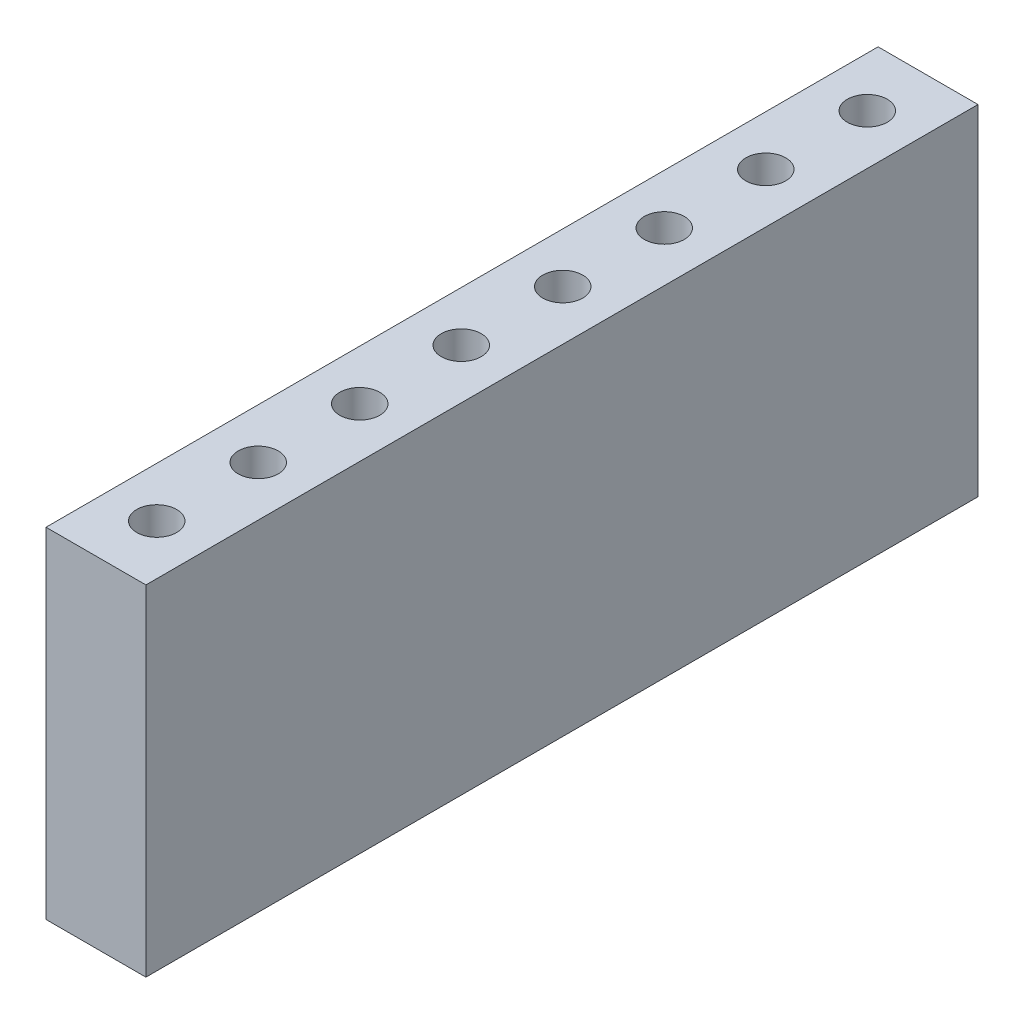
ISO-10303-21;
HEADER;
FILE_DESCRIPTION(('STEP AP214'),'2;1');
FILE_NAME('part.step','',(''),(''),'','','');
FILE_SCHEMA(('AUTOMOTIVE_DESIGN { 1 0 10303 214 1 1 1 1 }'));
ENDSEC;
DATA;
#1=APPLICATION_CONTEXT('core data for automotive mechanical design processes');
#2=APPLICATION_PROTOCOL_DEFINITION('international standard','automotive_design',2000,#1);
#3=PRODUCT_CONTEXT('',#1,'mechanical');
#4=PRODUCT('Part','Part','',(#3));
#5=PRODUCT_RELATED_PRODUCT_CATEGORY('part','',(#4));
#6=PRODUCT_DEFINITION_FORMATION('','',#4);
#7=PRODUCT_DEFINITION_CONTEXT('part definition',#1,'design');
#8=PRODUCT_DEFINITION('design','',#6,#7);
#9=PRODUCT_DEFINITION_SHAPE('','',#8);
#10=(LENGTH_UNIT() NAMED_UNIT(*) SI_UNIT(.MILLI.,.METRE.));
#11=(NAMED_UNIT(*) PLANE_ANGLE_UNIT() SI_UNIT($,.RADIAN.));
#12=(NAMED_UNIT(*) SI_UNIT($,.STERADIAN.) SOLID_ANGLE_UNIT());
#13=UNCERTAINTY_MEASURE_WITH_UNIT(LENGTH_MEASURE(1.E-05),#10,'distance_accuracy_value','');
#14=(GEOMETRIC_REPRESENTATION_CONTEXT(3) GLOBAL_UNCERTAINTY_ASSIGNED_CONTEXT((#13)) GLOBAL_UNIT_ASSIGNED_CONTEXT((#10,
#11,#12)) REPRESENTATION_CONTEXT('',''));
#15=CARTESIAN_POINT('',(0.,0.,0.));
#16=DIRECTION('',(0.,0.,1.));
#17=DIRECTION('',(1.,0.,0.));
#18=AXIS2_PLACEMENT_3D('',#15,#16,#17);
#19=CARTESIAN_POINT('',(0.,8.5,0.));
#20=DIRECTION('',(1.,0.,0.));
#21=DIRECTION('',(0.,0.,-1.));
#22=AXIS2_PLACEMENT_3D('',#19,#20,#21);
#23=PLANE('',#22);
#24=DIRECTION('',(0.,0.,1.));
#25=VECTOR('',#24,1.);
#26=CARTESIAN_POINT('',(0.,0.,0.));
#27=LINE('',#26,#25);
#28=CARTESIAN_POINT('',(0.,0.,-20.820000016));
#29=VERTEX_POINT('',#28);
#30=CARTESIAN_POINT('',(0.,0.,0.));
#31=VERTEX_POINT('',#30);
#32=EDGE_CURVE('E74',#29,#31,#27,.T.);
#33=ORIENTED_EDGE('',*,*,#32,.T.);
#34=DIRECTION('',(0.,-1.,0.));
#35=VECTOR('',#34,1.);
#36=CARTESIAN_POINT('',(0.,8.5,0.));
#37=LINE('',#36,#35);
#38=CARTESIAN_POINT('',(0.,8.5,0.));
#39=VERTEX_POINT('',#38);
#40=EDGE_CURVE('E11',#39,#31,#37,.T.);
#41=ORIENTED_EDGE('',*,*,#40,.F.);
#42=DIRECTION('',(0.,0.,1.));
#43=VECTOR('',#42,1.);
#44=CARTESIAN_POINT('',(0.,8.5,0.));
#45=LINE('',#44,#43);
#46=CARTESIAN_POINT('',(0.,8.5,-20.820000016));
#47=VERTEX_POINT('',#46);
#48=EDGE_CURVE('E97',#47,#39,#45,.T.);
#49=ORIENTED_EDGE('',*,*,#48,.F.);
#50=DIRECTION('',(0.,-1.,0.));
#51=VECTOR('',#50,1.);
#52=CARTESIAN_POINT('',(0.,8.5,-20.820000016));
#53=LINE('',#52,#51);
#54=EDGE_CURVE('E86',#47,#29,#53,.T.);
#55=ORIENTED_EDGE('',*,*,#54,.T.);
#56=EDGE_LOOP('',(#33,#41,#49,#55));
#57=FACE_BOUND('',#56,.T.);
#58=ADVANCED_FACE('F30',(#57),#23,.F.);
#59=CARTESIAN_POINT('',(0.,8.5,0.));
#60=DIRECTION('',(0.,0.,-1.));
#61=DIRECTION('',(-1.,0.,0.));
#62=AXIS2_PLACEMENT_3D('',#59,#60,#61);
#63=PLANE('',#62);
#64=DIRECTION('',(1.,0.,0.));
#65=VECTOR('',#64,1.);
#66=CARTESIAN_POINT('',(0.,0.,0.));
#67=LINE('',#66,#65);
#68=CARTESIAN_POINT('',(2.5,0.,0.));
#69=VERTEX_POINT('',#68);
#70=EDGE_CURVE('E70',#31,#69,#67,.T.);
#71=ORIENTED_EDGE('',*,*,#70,.T.);
#72=DIRECTION('',(0.,-1.,0.));
#73=VECTOR('',#72,1.);
#74=CARTESIAN_POINT('',(2.5,8.5,0.));
#75=LINE('',#74,#73);
#76=CARTESIAN_POINT('',(2.5,8.5,0.));
#77=VERTEX_POINT('',#76);
#78=EDGE_CURVE('E37',#77,#69,#75,.T.);
#79=ORIENTED_EDGE('',*,*,#78,.F.);
#80=DIRECTION('',(1.,0.,0.));
#81=VECTOR('',#80,1.);
#82=CARTESIAN_POINT('',(0.,8.5,0.));
#83=LINE('',#82,#81);
#84=EDGE_CURVE('E82',#39,#77,#83,.T.);
#85=ORIENTED_EDGE('',*,*,#84,.F.);
#86=ORIENTED_EDGE('',*,*,#40,.T.);
#87=EDGE_LOOP('',(#71,#79,#85,#86));
#88=FACE_BOUND('',#87,.T.);
#89=ADVANCED_FACE('F81',(#88),#63,.F.);
#90=CARTESIAN_POINT('',(2.5,8.5,0.));
#91=DIRECTION('',(-1.,0.,0.));
#92=DIRECTION('',(0.,0.,1.));
#93=AXIS2_PLACEMENT_3D('',#90,#91,#92);
#94=PLANE('',#93);
#95=DIRECTION('',(0.,0.,-1.));
#96=VECTOR('',#95,1.);
#97=CARTESIAN_POINT('',(2.5,0.,0.));
#98=LINE('',#97,#96);
#99=CARTESIAN_POINT('',(2.5,0.,-20.820000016));
#100=VERTEX_POINT('',#99);
#101=EDGE_CURVE('E75',#69,#100,#98,.T.);
#102=ORIENTED_EDGE('',*,*,#101,.T.);
#103=DIRECTION('',(0.,-1.,0.));
#104=VECTOR('',#103,1.);
#105=CARTESIAN_POINT('',(2.5,8.5,-20.820000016));
#106=LINE('',#105,#104);
#107=CARTESIAN_POINT('',(2.5,8.5,-20.820000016));
#108=VERTEX_POINT('',#107);
#109=EDGE_CURVE('E103',#108,#100,#106,.T.);
#110=ORIENTED_EDGE('',*,*,#109,.F.);
#111=DIRECTION('',(0.,0.,-1.));
#112=VECTOR('',#111,1.);
#113=CARTESIAN_POINT('',(2.5,8.5,0.));
#114=LINE('',#113,#112);
#115=EDGE_CURVE('E49',#77,#108,#114,.T.);
#116=ORIENTED_EDGE('',*,*,#115,.F.);
#117=ORIENTED_EDGE('',*,*,#78,.T.);
#118=EDGE_LOOP('',(#102,#110,#116,#117));
#119=FACE_BOUND('',#118,.T.);
#120=ADVANCED_FACE('F106',(#119),#94,.F.);
#121=CARTESIAN_POINT('',(0.,8.5,-20.820000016));
#122=DIRECTION('',(0.,0.,1.));
#123=DIRECTION('',(1.,0.,0.));
#124=AXIS2_PLACEMENT_3D('',#121,#122,#123);
#125=PLANE('',#124);
#126=DIRECTION('',(-1.,0.,0.));
#127=VECTOR('',#126,1.);
#128=CARTESIAN_POINT('',(0.,0.,-20.820000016));
#129=LINE('',#128,#127);
#130=EDGE_CURVE('E95',#100,#29,#129,.T.);
#131=ORIENTED_EDGE('',*,*,#130,.T.);
#132=ORIENTED_EDGE('',*,*,#54,.F.);
#133=DIRECTION('',(-1.,0.,0.));
#134=VECTOR('',#133,1.);
#135=CARTESIAN_POINT('',(0.,8.5,-20.820000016));
#136=LINE('',#135,#134);
#137=EDGE_CURVE('E44',#108,#47,#136,.T.);
#138=ORIENTED_EDGE('',*,*,#137,.F.);
#139=ORIENTED_EDGE('',*,*,#109,.T.);
#140=EDGE_LOOP('',(#131,#132,#138,#139));
#141=FACE_BOUND('',#140,.T.);
#142=ADVANCED_FACE('F108',(#141),#125,.F.);
#143=CARTESIAN_POINT('',(0.,8.5,-20.820000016));
#144=DIRECTION('',(0.,-1.,0.));
#145=DIRECTION('',(0.,0.,-1.));
#146=AXIS2_PLACEMENT_3D('',#143,#144,#145);
#147=PLANE('',#146);
#148=CARTESIAN_POINT('',(1.25,8.5,-11.680000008));
#149=DIRECTION('',(0.,1.,0.));
#150=DIRECTION('',(0.,0.,-1.));
#151=AXIS2_PLACEMENT_3D('',#148,#149,#150);
#152=CIRCLE('',#151,0.5);
#153=CARTESIAN_POINT('',(1.25,8.5,-12.180000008));
#154=VERTEX_POINT('',#153);
#155=EDGE_CURVE('E313',#154,#154,#152,.T.);
#156=ORIENTED_EDGE('',*,*,#155,.F.);
#157=EDGE_LOOP('',(#156));
#158=FACE_BOUND('',#157,.T.);
#159=CARTESIAN_POINT('',(1.25000000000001,8.5,-14.220000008));
#160=DIRECTION('',(0.,1.,0.));
#161=DIRECTION('',(0.,0.,-1.));
#162=AXIS2_PLACEMENT_3D('',#159,#160,#161);
#163=CIRCLE('',#162,0.5);
#164=CARTESIAN_POINT('',(1.25000000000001,8.5,-14.720000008));
#165=VERTEX_POINT('',#164);
#166=EDGE_CURVE('E312',#165,#165,#163,.T.);
#167=ORIENTED_EDGE('',*,*,#166,.F.);
#168=EDGE_LOOP('',(#167));
#169=FACE_BOUND('',#168,.T.);
#170=CARTESIAN_POINT('',(1.25000000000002,8.5,-16.760000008));
#171=DIRECTION('',(0.,1.,0.));
#172=DIRECTION('',(0.,0.,-1.));
#173=AXIS2_PLACEMENT_3D('',#170,#171,#172);
#174=CIRCLE('',#173,0.5);
#175=CARTESIAN_POINT('',(1.25000000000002,8.5,-17.260000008));
#176=VERTEX_POINT('',#175);
#177=EDGE_CURVE('E323',#176,#176,#174,.T.);
#178=ORIENTED_EDGE('',*,*,#177,.F.);
#179=EDGE_LOOP('',(#178));
#180=FACE_BOUND('',#179,.T.);
#181=CARTESIAN_POINT('',(1.25000000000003,8.5,-19.300000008));
#182=DIRECTION('',(0.,1.,0.));
#183=DIRECTION('',(0.,0.,-1.));
#184=AXIS2_PLACEMENT_3D('',#181,#182,#183);
#185=CIRCLE('',#184,0.5);
#186=CARTESIAN_POINT('',(1.25000000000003,8.5,-19.800000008));
#187=VERTEX_POINT('',#186);
#188=EDGE_CURVE('E329',#187,#187,#185,.T.);
#189=ORIENTED_EDGE('',*,*,#188,.F.);
#190=EDGE_LOOP('',(#189));
#191=FACE_BOUND('',#190,.T.);
#192=CARTESIAN_POINT('',(1.25000000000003,8.5,-1.520000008));
#193=DIRECTION('',(0.,1.,0.));
#194=DIRECTION('',(0.,0.,1.));
#195=AXIS2_PLACEMENT_3D('',#192,#193,#194);
#196=CIRCLE('',#195,0.5);
#197=CARTESIAN_POINT('',(1.25000000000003,8.5,-1.020000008));
#198=VERTEX_POINT('',#197);
#199=EDGE_CURVE('E335',#198,#198,#196,.T.);
#200=ORIENTED_EDGE('',*,*,#199,.F.);
#201=EDGE_LOOP('',(#200));
#202=FACE_BOUND('',#201,.T.);
#203=CARTESIAN_POINT('',(1.25000000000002,8.5,-4.060000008));
#204=DIRECTION('',(0.,1.,0.));
#205=DIRECTION('',(0.,0.,1.));
#206=AXIS2_PLACEMENT_3D('',#203,#204,#205);
#207=CIRCLE('',#206,0.5);
#208=CARTESIAN_POINT('',(1.25000000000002,8.5,-3.560000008));
#209=VERTEX_POINT('',#208);
#210=EDGE_CURVE('E341',#209,#209,#207,.T.);
#211=ORIENTED_EDGE('',*,*,#210,.F.);
#212=EDGE_LOOP('',(#211));
#213=FACE_BOUND('',#212,.T.);
#214=CARTESIAN_POINT('',(1.25000000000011,8.5,-6.600000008));
#215=DIRECTION('',(0.,1.,0.));
#216=DIRECTION('',(0.,0.,1.));
#217=AXIS2_PLACEMENT_3D('',#214,#215,#216);
#218=CIRCLE('',#217,0.500000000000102);
#219=CARTESIAN_POINT('',(1.25000000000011,8.5,-6.1000000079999));
#220=VERTEX_POINT('',#219);
#221=EDGE_CURVE('E347',#220,#220,#218,.T.);
#222=ORIENTED_EDGE('',*,*,#221,.F.);
#223=EDGE_LOOP('',(#222));
#224=FACE_BOUND('',#223,.T.);
#225=CARTESIAN_POINT('',(1.25,8.5,-9.140000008));
#226=DIRECTION('',(0.,1.,0.));
#227=DIRECTION('',(0.,0.,1.));
#228=AXIS2_PLACEMENT_3D('',#225,#226,#227);
#229=CIRCLE('',#228,0.5);
#230=CARTESIAN_POINT('',(1.25,8.5,-8.640000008));
#231=VERTEX_POINT('',#230);
#232=EDGE_CURVE('E90',#231,#231,#229,.T.);
#233=ORIENTED_EDGE('',*,*,#232,.F.);
#234=EDGE_LOOP('',(#233));
#235=FACE_BOUND('',#234,.T.);
#236=ORIENTED_EDGE('',*,*,#48,.T.);
#237=ORIENTED_EDGE('',*,*,#84,.T.);
#238=ORIENTED_EDGE('',*,*,#115,.T.);
#239=ORIENTED_EDGE('',*,*,#137,.T.);
#240=EDGE_LOOP('',(#236,#237,#238,#239));
#241=FACE_BOUND('',#240,.T.);
#242=ADVANCED_FACE('F109',(#158,#169,#180,#191,#202,#213,#224,#235,#241),#147,.F.);
#243=CARTESIAN_POINT('',(0.,0.,-20.820000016));
#244=DIRECTION('',(0.,-1.,0.));
#245=DIRECTION('',(0.,0.,-1.));
#246=AXIS2_PLACEMENT_3D('',#243,#244,#245);
#247=PLANE('',#246);
#248=ORIENTED_EDGE('',*,*,#32,.F.);
#249=ORIENTED_EDGE('',*,*,#130,.F.);
#250=ORIENTED_EDGE('',*,*,#101,.F.);
#251=ORIENTED_EDGE('',*,*,#70,.F.);
#252=EDGE_LOOP('',(#248,#249,#250,#251));
#253=FACE_BOUND('',#252,.T.);
#254=ADVANCED_FACE('F71',(#253),#247,.T.);
#255=CARTESIAN_POINT('',(1.25,2.12,-9.140000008));
#256=DIRECTION('',(0.,1.,0.));
#257=DIRECTION('',(0.,0.,1.));
#258=AXIS2_PLACEMENT_3D('',#255,#256,#257);
#259=CYLINDRICAL_SURFACE('',#258,0.5);
#260=CARTESIAN_POINT('',(1.25,2.12,-9.140000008));
#261=DIRECTION('',(0.,1.,0.));
#262=DIRECTION('',(0.,0.,1.));
#263=AXIS2_PLACEMENT_3D('',#260,#261,#262);
#264=CIRCLE('',#263,0.5);
#265=CARTESIAN_POINT('',(1.25,2.12,-8.640000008));
#266=VERTEX_POINT('',#265);
#267=EDGE_CURVE('E87',#266,#266,#264,.T.);
#268=ORIENTED_EDGE('',*,*,#267,.F.);
#269=EDGE_LOOP('',(#268));
#270=FACE_BOUND('',#269,.T.);
#271=ORIENTED_EDGE('',*,*,#232,.T.);
#272=EDGE_LOOP('',(#271));
#273=FACE_BOUND('',#272,.T.);
#274=ADVANCED_FACE('F117',(#270,#273),#259,.F.);
#275=CARTESIAN_POINT('',(1.25,2.12,-9.140000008));
#276=DIRECTION('',(0.,1.,0.));
#277=DIRECTION('',(0.,0.,1.));
#278=AXIS2_PLACEMENT_3D('',#275,#276,#277);
#279=PLANE('',#278);
#280=ORIENTED_EDGE('',*,*,#267,.T.);
#281=EDGE_LOOP('',(#280));
#282=FACE_BOUND('',#281,.T.);
#283=ADVANCED_FACE('F155',(#282),#279,.T.);
#284=CARTESIAN_POINT('',(1.25000000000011,2.12,-6.600000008));
#285=DIRECTION('',(0.,1.,0.));
#286=DIRECTION('',(0.,0.,1.));
#287=AXIS2_PLACEMENT_3D('',#284,#285,#286);
#288=CYLINDRICAL_SURFACE('',#287,0.500000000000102);
#289=CARTESIAN_POINT('',(1.25000000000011,2.12,-6.600000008));
#290=DIRECTION('',(0.,1.,0.));
#291=DIRECTION('',(0.,0.,1.));
#292=AXIS2_PLACEMENT_3D('',#289,#290,#291);
#293=CIRCLE('',#292,0.500000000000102);
#294=CARTESIAN_POINT('',(1.25000000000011,2.12,-6.1000000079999));
#295=VERTEX_POINT('',#294);
#296=EDGE_CURVE('E350',#295,#295,#293,.T.);
#297=ORIENTED_EDGE('',*,*,#296,.F.);
#298=EDGE_LOOP('',(#297));
#299=FACE_BOUND('',#298,.T.);
#300=ORIENTED_EDGE('',*,*,#221,.T.);
#301=EDGE_LOOP('',(#300));
#302=FACE_BOUND('',#301,.T.);
#303=ADVANCED_FACE('F165',(#299,#302),#288,.F.);
#304=CARTESIAN_POINT('',(1.25000000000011,2.12,-6.600000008));
#305=DIRECTION('',(0.,1.,0.));
#306=DIRECTION('',(0.,0.,1.));
#307=AXIS2_PLACEMENT_3D('',#304,#305,#306);
#308=PLANE('',#307);
#309=ORIENTED_EDGE('',*,*,#296,.T.);
#310=EDGE_LOOP('',(#309));
#311=FACE_BOUND('',#310,.T.);
#312=ADVANCED_FACE('F175',(#311),#308,.T.);
#313=CARTESIAN_POINT('',(1.25000000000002,2.12,-4.060000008));
#314=DIRECTION('',(0.,1.,0.));
#315=DIRECTION('',(0.,0.,1.));
#316=AXIS2_PLACEMENT_3D('',#313,#314,#315);
#317=CYLINDRICAL_SURFACE('',#316,0.5);
#318=CARTESIAN_POINT('',(1.25000000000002,2.12,-4.060000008));
#319=DIRECTION('',(0.,1.,0.));
#320=DIRECTION('',(0.,0.,1.));
#321=AXIS2_PLACEMENT_3D('',#318,#319,#320);
#322=CIRCLE('',#321,0.5);
#323=CARTESIAN_POINT('',(1.25000000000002,2.12,-3.560000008));
#324=VERTEX_POINT('',#323);
#325=EDGE_CURVE('E344',#324,#324,#322,.T.);
#326=ORIENTED_EDGE('',*,*,#325,.F.);
#327=EDGE_LOOP('',(#326));
#328=FACE_BOUND('',#327,.T.);
#329=ORIENTED_EDGE('',*,*,#210,.T.);
#330=EDGE_LOOP('',(#329));
#331=FACE_BOUND('',#330,.T.);
#332=ADVANCED_FACE('F185',(#328,#331),#317,.F.);
#333=CARTESIAN_POINT('',(1.25000000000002,2.12,-4.060000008));
#334=DIRECTION('',(0.,1.,0.));
#335=DIRECTION('',(0.,0.,1.));
#336=AXIS2_PLACEMENT_3D('',#333,#334,#335);
#337=PLANE('',#336);
#338=ORIENTED_EDGE('',*,*,#325,.T.);
#339=EDGE_LOOP('',(#338));
#340=FACE_BOUND('',#339,.T.);
#341=ADVANCED_FACE('F195',(#340),#337,.T.);
#342=CARTESIAN_POINT('',(1.25000000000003,2.12,-1.520000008));
#343=DIRECTION('',(0.,1.,0.));
#344=DIRECTION('',(0.,0.,1.));
#345=AXIS2_PLACEMENT_3D('',#342,#343,#344);
#346=CYLINDRICAL_SURFACE('',#345,0.5);
#347=CARTESIAN_POINT('',(1.25000000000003,2.12,-1.520000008));
#348=DIRECTION('',(0.,1.,0.));
#349=DIRECTION('',(0.,0.,1.));
#350=AXIS2_PLACEMENT_3D('',#347,#348,#349);
#351=CIRCLE('',#350,0.5);
#352=CARTESIAN_POINT('',(1.25000000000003,2.12,-1.020000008));
#353=VERTEX_POINT('',#352);
#354=EDGE_CURVE('E338',#353,#353,#351,.T.);
#355=ORIENTED_EDGE('',*,*,#354,.F.);
#356=EDGE_LOOP('',(#355));
#357=FACE_BOUND('',#356,.T.);
#358=ORIENTED_EDGE('',*,*,#199,.T.);
#359=EDGE_LOOP('',(#358));
#360=FACE_BOUND('',#359,.T.);
#361=ADVANCED_FACE('F205',(#357,#360),#346,.F.);
#362=CARTESIAN_POINT('',(1.25000000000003,2.12,-1.520000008));
#363=DIRECTION('',(0.,1.,0.));
#364=DIRECTION('',(0.,0.,1.));
#365=AXIS2_PLACEMENT_3D('',#362,#363,#364);
#366=PLANE('',#365);
#367=ORIENTED_EDGE('',*,*,#354,.T.);
#368=EDGE_LOOP('',(#367));
#369=FACE_BOUND('',#368,.T.);
#370=ADVANCED_FACE('F215',(#369),#366,.T.);
#371=CARTESIAN_POINT('',(1.25000000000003,2.12,-19.300000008));
#372=DIRECTION('',(0.,1.,0.));
#373=DIRECTION('',(0.,0.,1.));
#374=AXIS2_PLACEMENT_3D('',#371,#372,#373);
#375=CYLINDRICAL_SURFACE('',#374,0.5);
#376=CARTESIAN_POINT('',(1.25000000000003,2.12,-19.300000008));
#377=DIRECTION('',(0.,1.,0.));
#378=DIRECTION('',(0.,0.,-1.));
#379=AXIS2_PLACEMENT_3D('',#376,#377,#378);
#380=CIRCLE('',#379,0.5);
#381=CARTESIAN_POINT('',(1.25000000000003,2.12,-19.800000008));
#382=VERTEX_POINT('',#381);
#383=EDGE_CURVE('E332',#382,#382,#380,.T.);
#384=ORIENTED_EDGE('',*,*,#383,.F.);
#385=EDGE_LOOP('',(#384));
#386=FACE_BOUND('',#385,.T.);
#387=ORIENTED_EDGE('',*,*,#188,.T.);
#388=EDGE_LOOP('',(#387));
#389=FACE_BOUND('',#388,.T.);
#390=ADVANCED_FACE('F225',(#386,#389),#375,.F.);
#391=CARTESIAN_POINT('',(1.25000000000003,2.12,-19.300000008));
#392=DIRECTION('',(0.,-1.,0.));
#393=DIRECTION('',(0.,0.,-1.));
#394=AXIS2_PLACEMENT_3D('',#391,#392,#393);
#395=PLANE('',#394);
#396=ORIENTED_EDGE('',*,*,#383,.T.);
#397=EDGE_LOOP('',(#396));
#398=FACE_BOUND('',#397,.T.);
#399=ADVANCED_FACE('F235',(#398),#395,.F.);
#400=CARTESIAN_POINT('',(1.25000000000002,2.12,-16.760000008));
#401=DIRECTION('',(0.,1.,0.));
#402=DIRECTION('',(0.,0.,1.));
#403=AXIS2_PLACEMENT_3D('',#400,#401,#402);
#404=CYLINDRICAL_SURFACE('',#403,0.5);
#405=CARTESIAN_POINT('',(1.25000000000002,2.12,-16.760000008));
#406=DIRECTION('',(0.,1.,0.));
#407=DIRECTION('',(0.,0.,-1.));
#408=AXIS2_PLACEMENT_3D('',#405,#406,#407);
#409=CIRCLE('',#408,0.5);
#410=CARTESIAN_POINT('',(1.25000000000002,2.12,-17.260000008));
#411=VERTEX_POINT('',#410);
#412=EDGE_CURVE('E326',#411,#411,#409,.T.);
#413=ORIENTED_EDGE('',*,*,#412,.F.);
#414=EDGE_LOOP('',(#413));
#415=FACE_BOUND('',#414,.T.);
#416=ORIENTED_EDGE('',*,*,#177,.T.);
#417=EDGE_LOOP('',(#416));
#418=FACE_BOUND('',#417,.T.);
#419=ADVANCED_FACE('F245',(#415,#418),#404,.F.);
#420=CARTESIAN_POINT('',(1.25000000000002,2.12,-16.760000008));
#421=DIRECTION('',(0.,-1.,0.));
#422=DIRECTION('',(0.,0.,-1.));
#423=AXIS2_PLACEMENT_3D('',#420,#421,#422);
#424=PLANE('',#423);
#425=ORIENTED_EDGE('',*,*,#412,.T.);
#426=EDGE_LOOP('',(#425));
#427=FACE_BOUND('',#426,.T.);
#428=ADVANCED_FACE('F255',(#427),#424,.F.);
#429=CARTESIAN_POINT('',(1.25000000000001,2.12,-14.220000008));
#430=DIRECTION('',(0.,1.,0.));
#431=DIRECTION('',(0.,0.,1.));
#432=AXIS2_PLACEMENT_3D('',#429,#430,#431);
#433=CYLINDRICAL_SURFACE('',#432,0.5);
#434=CARTESIAN_POINT('',(1.25000000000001,2.12,-14.220000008));
#435=DIRECTION('',(0.,1.,0.));
#436=DIRECTION('',(0.,0.,-1.));
#437=AXIS2_PLACEMENT_3D('',#434,#435,#436);
#438=CIRCLE('',#437,0.5);
#439=CARTESIAN_POINT('',(1.25000000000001,2.12,-14.720000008));
#440=VERTEX_POINT('',#439);
#441=EDGE_CURVE('E316',#440,#440,#438,.T.);
#442=ORIENTED_EDGE('',*,*,#441,.F.);
#443=EDGE_LOOP('',(#442));
#444=FACE_BOUND('',#443,.T.);
#445=ORIENTED_EDGE('',*,*,#166,.T.);
#446=EDGE_LOOP('',(#445));
#447=FACE_BOUND('',#446,.T.);
#448=ADVANCED_FACE('F265',(#444,#447),#433,.F.);
#449=CARTESIAN_POINT('',(1.25000000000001,2.12,-14.220000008));
#450=DIRECTION('',(0.,-1.,0.));
#451=DIRECTION('',(0.,0.,-1.));
#452=AXIS2_PLACEMENT_3D('',#449,#450,#451);
#453=PLANE('',#452);
#454=ORIENTED_EDGE('',*,*,#441,.T.);
#455=EDGE_LOOP('',(#454));
#456=FACE_BOUND('',#455,.T.);
#457=ADVANCED_FACE('F275',(#456),#453,.F.);
#458=CARTESIAN_POINT('',(1.25,2.12,-11.680000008));
#459=DIRECTION('',(0.,1.,0.));
#460=DIRECTION('',(0.,0.,1.));
#461=AXIS2_PLACEMENT_3D('',#458,#459,#460);
#462=CYLINDRICAL_SURFACE('',#461,0.5);
#463=CARTESIAN_POINT('',(1.25,2.12,-11.680000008));
#464=DIRECTION('',(0.,1.,0.));
#465=DIRECTION('',(0.,0.,-1.));
#466=AXIS2_PLACEMENT_3D('',#463,#464,#465);
#467=CIRCLE('',#466,0.5);
#468=CARTESIAN_POINT('',(1.25,2.12,-12.180000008));
#469=VERTEX_POINT('',#468);
#470=EDGE_CURVE('E311',#469,#469,#467,.T.);
#471=ORIENTED_EDGE('',*,*,#470,.F.);
#472=EDGE_LOOP('',(#471));
#473=FACE_BOUND('',#472,.T.);
#474=ORIENTED_EDGE('',*,*,#155,.T.);
#475=EDGE_LOOP('',(#474));
#476=FACE_BOUND('',#475,.T.);
#477=ADVANCED_FACE('F285',(#473,#476),#462,.F.);
#478=CARTESIAN_POINT('',(1.25,2.12,-11.680000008));
#479=DIRECTION('',(0.,-1.,0.));
#480=DIRECTION('',(0.,0.,-1.));
#481=AXIS2_PLACEMENT_3D('',#478,#479,#480);
#482=PLANE('',#481);
#483=ORIENTED_EDGE('',*,*,#470,.T.);
#484=EDGE_LOOP('',(#483));
#485=FACE_BOUND('',#484,.T.);
#486=ADVANCED_FACE('F295',(#485),#482,.F.);
#487=CLOSED_SHELL('',(#58,#89,#120,#142,#242,#254,#274,#283,#303,#312,#332,#341,#361,#370,#390,
#399,#419,#428,#448,#457,#477,#486));
#488=MANIFOLD_SOLID_BREP('B2',#487);
#489=ADVANCED_BREP_SHAPE_REPRESENTATION('',(#18,#488),#14);
#490=SHAPE_DEFINITION_REPRESENTATION(#9,#489);
ENDSEC;
END-ISO-10303-21;
